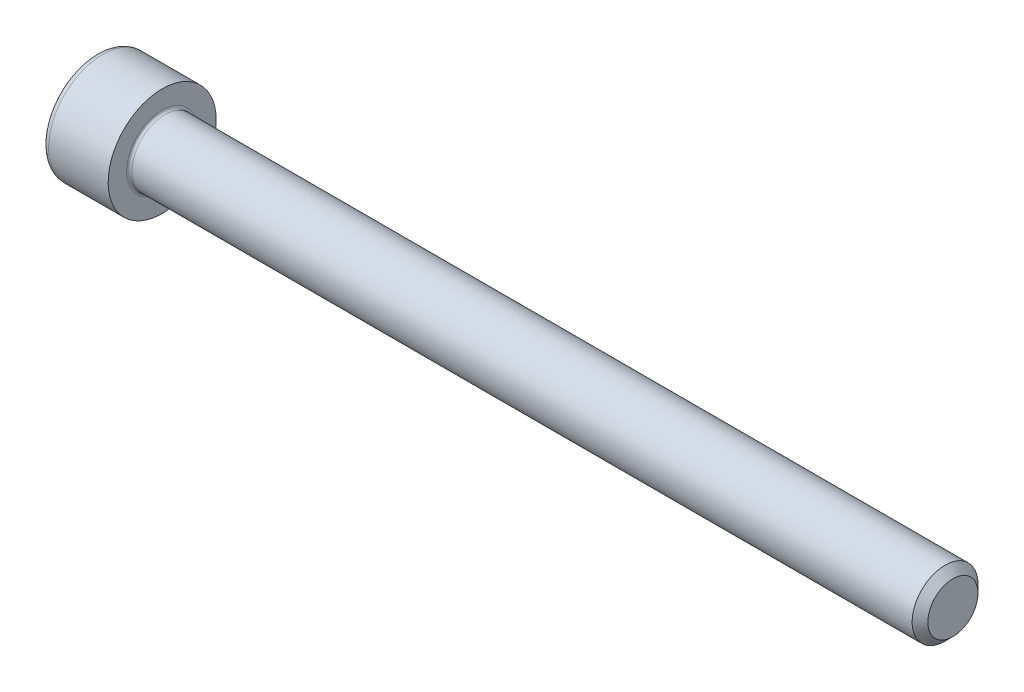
ISO-10303-21;
HEADER;
FILE_DESCRIPTION(('STEP AP214'),'2;1');
FILE_NAME('part.step','',(''),(''),'','','');
FILE_SCHEMA(('AUTOMOTIVE_DESIGN { 1 0 10303 214 1 1 1 1 }'));
ENDSEC;
DATA;
#1=APPLICATION_CONTEXT('core data for automotive mechanical design processes');
#2=APPLICATION_PROTOCOL_DEFINITION('international standard','automotive_design',2000,#1);
#3=PRODUCT_CONTEXT('',#1,'mechanical');
#4=PRODUCT('Part','Part','',(#3));
#5=PRODUCT_RELATED_PRODUCT_CATEGORY('part','',(#4));
#6=PRODUCT_DEFINITION_FORMATION('','',#4);
#7=PRODUCT_DEFINITION_CONTEXT('part definition',#1,'design');
#8=PRODUCT_DEFINITION('design','',#6,#7);
#9=PRODUCT_DEFINITION_SHAPE('','',#8);
#10=(LENGTH_UNIT() NAMED_UNIT(*) SI_UNIT(.MILLI.,.METRE.));
#11=(NAMED_UNIT(*) PLANE_ANGLE_UNIT() SI_UNIT($,.RADIAN.));
#12=(NAMED_UNIT(*) SI_UNIT($,.STERADIAN.) SOLID_ANGLE_UNIT());
#13=UNCERTAINTY_MEASURE_WITH_UNIT(LENGTH_MEASURE(1.E-05),#10,'distance_accuracy_value','');
#14=(GEOMETRIC_REPRESENTATION_CONTEXT(3) GLOBAL_UNCERTAINTY_ASSIGNED_CONTEXT((#13)) GLOBAL_UNIT_ASSIGNED_CONTEXT((#10,
#11,#12)) REPRESENTATION_CONTEXT('',''));
#15=CARTESIAN_POINT('',(0.,0.,0.));
#16=DIRECTION('',(0.,0.,1.));
#17=DIRECTION('',(1.,0.,0.));
#18=AXIS2_PLACEMENT_3D('',#15,#16,#17);
#19=CARTESIAN_POINT('',(-1.73197520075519,0.,0.));
#20=DIRECTION('',(-1.,0.,0.));
#21=DIRECTION('',(0.,0.,1.));
#22=AXIS2_PLACEMENT_3D('',#19,#20,#21);
#23=CONICAL_SURFACE('',#22,1.38675239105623,1.04719754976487);
#24=CARTESIAN_POINT('',(-0.931333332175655,-1.70530256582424E-10,0.));
#25=VERTEX_POINT('',#24);
#26=VERTEX_LOOP('',#25);
#27=FACE_BOUND('',#26,.T.);
#28=CARTESIAN_POINT('',(-1.72720000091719,1.19380000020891,0.689240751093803));
#29=CARTESIAN_POINT('',(-1.70970817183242,1.19380000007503,0.628664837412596));
#30=CARTESIAN_POINT('',(-1.69380026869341,1.19380000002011,0.567566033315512));
#31=CARTESIAN_POINT('',(-1.66603350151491,1.19379999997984,0.444310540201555));
#32=CARTESIAN_POINT('',(-1.65418445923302,1.19379999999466,0.382151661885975));
#33=CARTESIAN_POINT('',(-1.63574057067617,1.1938000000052,0.258604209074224));
#34=CARTESIAN_POINT('',(-1.62902295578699,1.19380000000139,0.197234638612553));
#35=CARTESIAN_POINT('',(-1.62100502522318,1.19379999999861,0.074206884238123));
#36=CARTESIAN_POINT('',(-1.61969806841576,1.19379999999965,0.0125491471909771));
#37=CARTESIAN_POINT('',(-1.62242392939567,1.1938000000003,-0.102651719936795));
#38=CARTESIAN_POINT('',(-1.62578745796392,1.19380000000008,-0.15621213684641));
#39=CARTESIAN_POINT('',(-1.63644571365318,1.19379999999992,-0.262984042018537));
#40=CARTESIAN_POINT('',(-1.64374407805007,1.19379999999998,-0.316195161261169));
#41=CARTESIAN_POINT('',(-1.66198857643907,1.19380000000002,-0.423187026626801));
#42=CARTESIAN_POINT('',(-1.67301201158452,1.19380000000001,-0.476954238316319));
#43=CARTESIAN_POINT('',(-1.69803054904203,1.19379999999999,-0.58368695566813));
#44=CARTESIAN_POINT('',(-1.71201977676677,1.19379999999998,-0.636653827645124));
#45=CARTESIAN_POINT('',(-1.72720000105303,1.1938,-0.689240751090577));
#46=B_SPLINE_CURVE_WITH_KNOTS('',3,(#28,#29,#30,#31,#32,#33,#34,#35,#36,#37,#38,#39,#40,#41,#42,
#43,#44,#45),.UNSPECIFIED.,.F.,.F.,(4,2,2,2,2,2,2,2,4),(0.,0.18922685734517,0.378908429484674,
0.563895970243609,0.748656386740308,0.909501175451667,1.07049490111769,1.23505869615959,
1.39929952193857),.UNSPECIFIED.);
#47=CARTESIAN_POINT('',(-1.72720000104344,1.19379999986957,0.68924075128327));
#48=VERTEX_POINT('',#47);
#49=CARTESIAN_POINT('',(-1.72720000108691,1.1938,-0.689240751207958));
#50=VERTEX_POINT('',#49);
#51=EDGE_CURVE('E20',#48,#50,#46,.T.);
#52=ORIENTED_EDGE('',*,*,#51,.T.);
#53=CARTESIAN_POINT('',(-1.72720000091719,1.19379999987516,-0.689240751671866));
#54=CARTESIAN_POINT('',(-1.70970817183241,1.14133971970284,-0.71952870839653));
#55=CARTESIAN_POINT('',(-1.6938002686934,1.08842660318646,-0.750078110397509));
#56=CARTESIAN_POINT('',(-1.6660335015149,0.981684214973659,-0.811705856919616));
#57=CARTESIAN_POINT('',(-1.65418445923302,0.927853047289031,-0.842785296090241));
#58=CARTESIAN_POINT('',(-1.63574057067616,0.820857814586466,-0.904559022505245));
#59=CARTESIAN_POINT('',(-1.62902295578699,0.767710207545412,-0.935243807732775));
#60=CARTESIAN_POINT('',(-1.62100502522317,0.661165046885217,-0.996757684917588));
#61=CARTESIAN_POINT('',(-1.61969806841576,0.607767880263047,-1.02758655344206));
#62=CARTESIAN_POINT('',(-1.62242392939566,0.508001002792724,-1.08518698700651));
#63=CARTESIAN_POINT('',(-1.62578745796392,0.461616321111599,-1.11196719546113));
#64=CARTESIAN_POINT('',(-1.63644571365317,0.369149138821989,-1.16535314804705));
#65=CARTESIAN_POINT('',(-1.64374407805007,0.323066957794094,-1.19195870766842));
#66=CARTESIAN_POINT('',(-1.66198857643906,0.230409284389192,-1.24545464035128));
#67=CARTESIAN_POINT('',(-1.67301201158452,0.183845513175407,-1.27233824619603));
#68=CARTESIAN_POINT('',(-1.69803054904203,0.0914122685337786,-1.32570460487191));
#69=CARTESIAN_POINT('',(-1.71201977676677,0.045541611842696,-1.3521880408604));
#70=CARTESIAN_POINT('',(-1.72720000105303,2.32076375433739E-10,-1.37848150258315));
#71=B_SPLINE_CURVE_WITH_KNOTS('',3,(#53,#54,#55,#56,#57,#58,#59,#60,#61,#62,#63,#64,#65,#66,#67,
#68,#69,#70),.UNSPECIFIED.,.F.,.F.,(4,2,2,2,2,2,2,2,4),(0.,0.18922685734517,0.378908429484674,
0.563895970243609,0.748656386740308,0.909501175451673,1.07049490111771,1.23505869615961,
1.3992995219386),.UNSPECIFIED.);
#72=CARTESIAN_POINT('',(-1.72720000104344,0.,-1.37848150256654));
#73=VERTEX_POINT('',#72);
#74=EDGE_CURVE('E80',#50,#73,#71,.T.);
#75=ORIENTED_EDGE('',*,*,#74,.T.);
#76=CARTESIAN_POINT('',(-1.72720000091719,-3.3375484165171E-10,-1.37848150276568));
#77=CARTESIAN_POINT('',(-1.70970817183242,-0.0524602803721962,-1.34819354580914));
#78=CARTESIAN_POINT('',(-1.69380026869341,-0.105373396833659,-1.31764414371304));
#79=CARTESIAN_POINT('',(-1.66603350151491,-0.212115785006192,-1.25601639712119));
#80=CARTESIAN_POINT('',(-1.65418445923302,-0.265946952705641,-1.22493695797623));
#81=CARTESIAN_POINT('',(-1.63574057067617,-0.372942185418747,-1.16316323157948));
#82=CARTESIAN_POINT('',(-1.62902295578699,-0.426089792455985,-1.13247844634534));
#83=CARTESIAN_POINT('',(-1.62100502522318,-0.532634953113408,-1.07096456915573));
#84=CARTESIAN_POINT('',(-1.61969806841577,-0.586032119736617,-1.04013570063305));
#85=CARTESIAN_POINT('',(-1.62242392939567,-0.685798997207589,-0.982535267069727));
#86=CARTESIAN_POINT('',(-1.62578745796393,-0.732183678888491,-0.955755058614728));
#87=CARTESIAN_POINT('',(-1.63644571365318,-0.824650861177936,-0.902369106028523));
#88=CARTESIAN_POINT('',(-1.64374407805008,-0.870733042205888,-0.875763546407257));
#89=CARTESIAN_POINT('',(-1.66198857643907,-0.963390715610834,-0.822267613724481));
#90=CARTESIAN_POINT('',(-1.67301201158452,-1.00995448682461,-0.795384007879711));
#91=CARTESIAN_POINT('',(-1.69803054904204,-1.10238773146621,-0.742017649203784));
#92=CARTESIAN_POINT('',(-1.71201977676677,-1.14825838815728,-0.715534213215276));
#93=CARTESIAN_POINT('',(-1.72720000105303,-1.19379999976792,-0.68924075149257));
#94=B_SPLINE_CURVE_WITH_KNOTS('',3,(#76,#77,#78,#79,#80,#81,#82,#83,#84,#85,#86,#87,#88,#89,#90,
#91,#92,#93),.UNSPECIFIED.,.F.,.F.,(4,2,2,2,2,2,2,2,4),(0.,0.189226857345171,0.378908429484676,
0.563895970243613,0.748656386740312,0.909501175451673,1.0704949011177,1.2350586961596,
1.39929952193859),.UNSPECIFIED.);
#95=CARTESIAN_POINT('',(-1.72720000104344,-1.19379999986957,-0.68924075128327));
#96=VERTEX_POINT('',#95);
#97=EDGE_CURVE('E105',#73,#96,#94,.T.);
#98=ORIENTED_EDGE('',*,*,#97,.T.);
#99=CARTESIAN_POINT('',(-1.72720000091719,-1.19380000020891,-0.689240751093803));
#100=CARTESIAN_POINT('',(-1.70970817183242,-1.19380000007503,-0.628664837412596));
#101=CARTESIAN_POINT('',(-1.69380026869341,-1.19380000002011,-0.567566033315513));
#102=CARTESIAN_POINT('',(-1.66603350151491,-1.19379999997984,-0.444310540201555));
#103=CARTESIAN_POINT('',(-1.65418445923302,-1.19379999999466,-0.382151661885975));
#104=CARTESIAN_POINT('',(-1.63574057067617,-1.1938000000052,-0.258604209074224));
#105=CARTESIAN_POINT('',(-1.62902295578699,-1.19380000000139,-0.197234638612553));
#106=CARTESIAN_POINT('',(-1.62100502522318,-1.19379999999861,-0.0742068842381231));
#107=CARTESIAN_POINT('',(-1.61969806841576,-1.19379999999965,-0.0125491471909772));
#108=CARTESIAN_POINT('',(-1.62242392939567,-1.1938000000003,0.102651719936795));
#109=CARTESIAN_POINT('',(-1.62578745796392,-1.19380000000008,0.15621213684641));
#110=CARTESIAN_POINT('',(-1.63644571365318,-1.19379999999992,0.262984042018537));
#111=CARTESIAN_POINT('',(-1.64374407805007,-1.19379999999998,0.316195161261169));
#112=CARTESIAN_POINT('',(-1.66198857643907,-1.19380000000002,0.423187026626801));
#113=CARTESIAN_POINT('',(-1.67301201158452,-1.19380000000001,0.476954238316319));
#114=CARTESIAN_POINT('',(-1.69803054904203,-1.19379999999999,0.58368695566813));
#115=CARTESIAN_POINT('',(-1.71201977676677,-1.19379999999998,0.636653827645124));
#116=CARTESIAN_POINT('',(-1.72720000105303,-1.1938,0.689240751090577));
#117=B_SPLINE_CURVE_WITH_KNOTS('',3,(#99,#100,#101,#102,#103,#104,#105,#106,#107,#108,#109,#110,
#111,#112,#113,#114,#115,#116),.UNSPECIFIED.,.F.,.F.,(4,2,2,2,2,2,2,2,4),(0.,0.18922685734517,
0.378908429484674,0.563895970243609,0.748656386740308,0.909501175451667,1.07049490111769,
1.23505869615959,1.39929952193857),.UNSPECIFIED.);
#118=CARTESIAN_POINT('',(-1.72720000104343,-1.19379999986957,0.689240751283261));
#119=VERTEX_POINT('',#118);
#120=EDGE_CURVE('E129',#96,#119,#117,.T.);
#121=ORIENTED_EDGE('',*,*,#120,.T.);
#122=CARTESIAN_POINT('',(-1.72720000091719,-1.19379999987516,0.689240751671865));
#123=CARTESIAN_POINT('',(-1.70970817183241,-1.14133971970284,0.71952870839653));
#124=CARTESIAN_POINT('',(-1.6938002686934,-1.08842660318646,0.750078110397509));
#125=CARTESIAN_POINT('',(-1.6660335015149,-0.981684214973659,0.811705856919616));
#126=CARTESIAN_POINT('',(-1.65418445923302,-0.927853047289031,0.842785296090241));
#127=CARTESIAN_POINT('',(-1.63574057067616,-0.820857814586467,0.904559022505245));
#128=CARTESIAN_POINT('',(-1.62902295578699,-0.767710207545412,0.935243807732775));
#129=CARTESIAN_POINT('',(-1.62100502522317,-0.661165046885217,0.996757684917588));
#130=CARTESIAN_POINT('',(-1.61969806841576,-0.607767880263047,1.02758655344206));
#131=CARTESIAN_POINT('',(-1.62242392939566,-0.508001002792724,1.08518698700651));
#132=CARTESIAN_POINT('',(-1.62578745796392,-0.461616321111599,1.11196719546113));
#133=CARTESIAN_POINT('',(-1.63644571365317,-0.36914913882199,1.16535314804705));
#134=CARTESIAN_POINT('',(-1.64374407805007,-0.323066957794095,1.19195870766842));
#135=CARTESIAN_POINT('',(-1.66198857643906,-0.230409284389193,1.24545464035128));
#136=CARTESIAN_POINT('',(-1.67301201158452,-0.183845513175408,1.27233824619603));
#137=CARTESIAN_POINT('',(-1.69803054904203,-0.0914122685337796,1.32570460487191));
#138=CARTESIAN_POINT('',(-1.71201977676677,-0.045541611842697,1.3521880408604));
#139=CARTESIAN_POINT('',(-1.72720000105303,-2.32077619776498E-10,1.37848150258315));
#140=B_SPLINE_CURVE_WITH_KNOTS('',3,(#122,#123,#124,#125,#126,#127,#128,#129,#130,#131,#132,
#133,#134,#135,#136,#137,#138,#139),.UNSPECIFIED.,.F.,.F.,(4,2,2,2,2,2,2,2,4),(0.,
0.18922685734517,0.378908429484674,0.563895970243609,0.748656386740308,0.909501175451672,
1.0704949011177,1.2350586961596,1.3992995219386),.UNSPECIFIED.);
#141=CARTESIAN_POINT('',(-1.72720000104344,0.,1.37848150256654));
#142=VERTEX_POINT('',#141);
#143=EDGE_CURVE('E137',#119,#142,#140,.T.);
#144=ORIENTED_EDGE('',*,*,#143,.T.);
#145=CARTESIAN_POINT('',(-1.72720000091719,3.33753688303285E-10,1.37848150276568));
#146=CARTESIAN_POINT('',(-1.70970817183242,0.0524602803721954,1.34819354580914));
#147=CARTESIAN_POINT('',(-1.69380026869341,0.105373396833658,1.31764414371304));
#148=CARTESIAN_POINT('',(-1.66603350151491,0.212115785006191,1.25601639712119));
#149=CARTESIAN_POINT('',(-1.65418445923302,0.26594695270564,1.22493695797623));
#150=CARTESIAN_POINT('',(-1.63574057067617,0.372942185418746,1.16316323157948));
#151=CARTESIAN_POINT('',(-1.62902295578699,0.426089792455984,1.13247844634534));
#152=CARTESIAN_POINT('',(-1.62100502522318,0.532634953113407,1.07096456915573));
#153=CARTESIAN_POINT('',(-1.61969806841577,0.586032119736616,1.04013570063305));
#154=CARTESIAN_POINT('',(-1.62242392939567,0.685798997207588,0.982535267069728));
#155=CARTESIAN_POINT('',(-1.62578745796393,0.732183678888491,0.955755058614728));
#156=CARTESIAN_POINT('',(-1.63644571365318,0.824650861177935,0.902369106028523));
#157=CARTESIAN_POINT('',(-1.64374407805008,0.870733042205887,0.875763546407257));
#158=CARTESIAN_POINT('',(-1.66198857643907,0.963390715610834,0.822267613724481));
#159=CARTESIAN_POINT('',(-1.67301201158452,1.00995448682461,0.795384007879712));
#160=CARTESIAN_POINT('',(-1.69803054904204,1.10238773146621,0.742017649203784));
#161=CARTESIAN_POINT('',(-1.71201977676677,1.14825838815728,0.715534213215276));
#162=CARTESIAN_POINT('',(-1.72720000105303,1.19379999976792,0.68924075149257));
#163=B_SPLINE_CURVE_WITH_KNOTS('',3,(#145,#146,#147,#148,#149,#150,#151,#152,#153,#154,#155,
#156,#157,#158,#159,#160,#161,#162),.UNSPECIFIED.,.F.,.F.,(4,2,2,2,2,2,2,2,4),(0.,
0.189226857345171,0.378908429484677,0.563895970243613,0.748656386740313,0.909501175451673,
1.0704949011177,1.2350586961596,1.39929952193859),.UNSPECIFIED.);
#164=EDGE_CURVE('E82',#142,#48,#163,.T.);
#165=ORIENTED_EDGE('',*,*,#164,.T.);
#166=EDGE_LOOP('',(#52,#75,#98,#121,#144,#165));
#167=FACE_BOUND('',#166,.T.);
#168=ADVANCED_FACE('F16',(#27,#167),#23,.F.);
#169=CARTESIAN_POINT('',(-3.175,1.1938,0.689240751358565));
#170=DIRECTION('',(0.,1.,0.));
#171=DIRECTION('',(0.,0.,1.));
#172=AXIS2_PLACEMENT_3D('',#169,#170,#171);
#173=PLANE('',#172);
#174=DIRECTION('',(1.,0.,0.));
#175=VECTOR('',#174,1.);
#176=CARTESIAN_POINT('',(-3.175,1.19380000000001,0.689240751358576));
#177=LINE('',#176,#175);
#178=CARTESIAN_POINT('',(-3.175,1.1938,0.689240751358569));
#179=VERTEX_POINT('',#178);
#180=EDGE_CURVE('E84',#48,#179,#177,.F.);
#181=ORIENTED_EDGE('',*,*,#180,.T.);
#182=DIRECTION('',(0.,0.,1.));
#183=VECTOR('',#182,1.);
#184=CARTESIAN_POINT('',(-3.175,1.1938,0.));
#185=LINE('',#184,#183);
#186=CARTESIAN_POINT('',(-3.175,1.1938,-0.689240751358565));
#187=VERTEX_POINT('',#186);
#188=EDGE_CURVE('E89',#187,#179,#185,.T.);
#189=ORIENTED_EDGE('',*,*,#188,.F.);
#190=DIRECTION('',(1.,0.,0.));
#191=VECTOR('',#190,1.);
#192=CARTESIAN_POINT('',(-3.175,1.1938,-0.689240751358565));
#193=LINE('',#192,#191);
#194=EDGE_CURVE('E87',#187,#50,#193,.T.);
#195=ORIENTED_EDGE('',*,*,#194,.T.);
#196=ORIENTED_EDGE('',*,*,#51,.F.);
#197=EDGE_LOOP('',(#181,#189,#195,#196));
#198=FACE_BOUND('',#197,.T.);
#199=ADVANCED_FACE('F76',(#198),#173,.F.);
#200=CARTESIAN_POINT('',(-3.175,0.,1.37848150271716));
#201=DIRECTION('',(0.,0.5,0.866025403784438));
#202=DIRECTION('',(0.,-0.866025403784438,0.5));
#203=AXIS2_PLACEMENT_3D('',#200,#201,#202);
#204=PLANE('',#203);
#205=DIRECTION('',(1.,0.,0.));
#206=VECTOR('',#205,1.);
#207=CARTESIAN_POINT('',(-3.175,0.,1.37848150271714));
#208=LINE('',#207,#206);
#209=CARTESIAN_POINT('',(-3.175,0.,1.37848150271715));
#210=VERTEX_POINT('',#209);
#211=EDGE_CURVE('E141',#142,#210,#208,.F.);
#212=ORIENTED_EDGE('',*,*,#211,.T.);
#213=DIRECTION('',(0.,-0.866025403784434,0.500000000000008));
#214=VECTOR('',#213,1.);
#215=CARTESIAN_POINT('',(-3.175,1.1938,0.689240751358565));
#216=LINE('',#215,#214);
#217=EDGE_CURVE('E95',#179,#210,#216,.T.);
#218=ORIENTED_EDGE('',*,*,#217,.F.);
#219=ORIENTED_EDGE('',*,*,#180,.F.);
#220=ORIENTED_EDGE('',*,*,#164,.F.);
#221=EDGE_LOOP('',(#212,#218,#219,#220));
#222=FACE_BOUND('',#221,.T.);
#223=ADVANCED_FACE('F145',(#222),#204,.F.);
#224=CARTESIAN_POINT('',(-3.175,-1.1938,0.689240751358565));
#225=DIRECTION('',(0.,-0.5,0.866025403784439));
#226=DIRECTION('',(0.,-0.866025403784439,-0.5));
#227=AXIS2_PLACEMENT_3D('',#224,#225,#226);
#228=PLANE('',#227);
#229=DIRECTION('',(1.,0.,0.));
#230=VECTOR('',#229,1.);
#231=CARTESIAN_POINT('',(-3.175,-1.1938,0.689240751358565));
#232=LINE('',#231,#230);
#233=CARTESIAN_POINT('',(-3.175,-1.1938,0.689240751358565));
#234=VERTEX_POINT('',#233);
#235=EDGE_CURVE('E136',#119,#234,#232,.F.);
#236=ORIENTED_EDGE('',*,*,#235,.T.);
#237=DIRECTION('',(0.,-0.866025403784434,-0.500000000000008));
#238=VECTOR('',#237,1.);
#239=CARTESIAN_POINT('',(-3.175,0.,1.37848150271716));
#240=LINE('',#239,#238);
#241=EDGE_CURVE('E264',#210,#234,#240,.T.);
#242=ORIENTED_EDGE('',*,*,#241,.F.);
#243=ORIENTED_EDGE('',*,*,#211,.F.);
#244=ORIENTED_EDGE('',*,*,#143,.F.);
#245=EDGE_LOOP('',(#236,#242,#243,#244));
#246=FACE_BOUND('',#245,.T.);
#247=ADVANCED_FACE('F125',(#246),#228,.F.);
#248=CARTESIAN_POINT('',(-3.175,-1.1938,-0.689240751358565));
#249=DIRECTION('',(0.,-1.,0.));
#250=DIRECTION('',(0.,0.,-1.));
#251=AXIS2_PLACEMENT_3D('',#248,#249,#250);
#252=PLANE('',#251);
#253=DIRECTION('',(1.,0.,0.));
#254=VECTOR('',#253,1.);
#255=CARTESIAN_POINT('',(-3.175,-1.19380000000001,-0.689240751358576));
#256=LINE('',#255,#254);
#257=CARTESIAN_POINT('',(-3.175,-1.1938,-0.68924075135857));
#258=VERTEX_POINT('',#257);
#259=EDGE_CURVE('E135',#96,#258,#256,.F.);
#260=ORIENTED_EDGE('',*,*,#259,.T.);
#261=DIRECTION('',(0.,0.,1.));
#262=VECTOR('',#261,1.);
#263=CARTESIAN_POINT('',(-3.175,-1.1938,0.));
#264=LINE('',#263,#262);
#265=EDGE_CURVE('E259',#234,#258,#264,.F.);
#266=ORIENTED_EDGE('',*,*,#265,.F.);
#267=ORIENTED_EDGE('',*,*,#235,.F.);
#268=ORIENTED_EDGE('',*,*,#120,.F.);
#269=EDGE_LOOP('',(#260,#266,#267,#268));
#270=FACE_BOUND('',#269,.T.);
#271=ADVANCED_FACE('F121',(#270),#252,.F.);
#272=CARTESIAN_POINT('',(-3.175,0.,-1.37848150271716));
#273=DIRECTION('',(0.,-0.5,-0.866025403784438));
#274=DIRECTION('',(0.,0.866025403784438,-0.5));
#275=AXIS2_PLACEMENT_3D('',#272,#273,#274);
#276=PLANE('',#275);
#277=DIRECTION('',(1.,0.,0.));
#278=VECTOR('',#277,1.);
#279=CARTESIAN_POINT('',(-3.175,0.,-1.37848150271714));
#280=LINE('',#279,#278);
#281=CARTESIAN_POINT('',(-3.175,0.,-1.37848150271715));
#282=VERTEX_POINT('',#281);
#283=EDGE_CURVE('E38',#73,#282,#280,.F.);
#284=ORIENTED_EDGE('',*,*,#283,.T.);
#285=DIRECTION('',(0.,0.866025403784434,-0.500000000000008));
#286=VECTOR('',#285,1.);
#287=CARTESIAN_POINT('',(-3.175,-1.1938,-0.689240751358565));
#288=LINE('',#287,#286);
#289=EDGE_CURVE('E254',#258,#282,#288,.T.);
#290=ORIENTED_EDGE('',*,*,#289,.F.);
#291=ORIENTED_EDGE('',*,*,#259,.F.);
#292=ORIENTED_EDGE('',*,*,#97,.F.);
#293=EDGE_LOOP('',(#284,#290,#291,#292));
#294=FACE_BOUND('',#293,.T.);
#295=ADVANCED_FACE('F115',(#294),#276,.F.);
#296=CARTESIAN_POINT('',(-3.175,1.1938,-0.689240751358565));
#297=DIRECTION('',(0.,0.5,-0.866025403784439));
#298=DIRECTION('',(0.,0.866025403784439,0.5));
#299=AXIS2_PLACEMENT_3D('',#296,#297,#298);
#300=PLANE('',#299);
#301=ORIENTED_EDGE('',*,*,#194,.F.);
#302=DIRECTION('',(0.,0.866025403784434,0.500000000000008));
#303=VECTOR('',#302,1.);
#304=CARTESIAN_POINT('',(-3.175,0.,-1.37848150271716));
#305=LINE('',#304,#303);
#306=EDGE_CURVE('E252',#282,#187,#305,.T.);
#307=ORIENTED_EDGE('',*,*,#306,.F.);
#308=ORIENTED_EDGE('',*,*,#283,.F.);
#309=ORIENTED_EDGE('',*,*,#74,.F.);
#310=EDGE_LOOP('',(#301,#307,#308,#309));
#311=FACE_BOUND('',#310,.T.);
#312=ADVANCED_FACE('F93',(#311),#300,.F.);
#313=CARTESIAN_POINT('',(-3.175,1.99099075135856,0.));
#314=DIRECTION('',(-1.,0.,0.));
#315=DIRECTION('',(0.,0.,1.));
#316=AXIS2_PLACEMENT_3D('',#313,#314,#315);
#317=PLANE('',#316);
#318=ORIENTED_EDGE('',*,*,#289,.T.);
#319=ORIENTED_EDGE('',*,*,#306,.T.);
#320=ORIENTED_EDGE('',*,*,#188,.T.);
#321=ORIENTED_EDGE('',*,*,#217,.T.);
#322=ORIENTED_EDGE('',*,*,#241,.T.);
#323=ORIENTED_EDGE('',*,*,#265,.T.);
#324=EDGE_LOOP('',(#318,#319,#320,#321,#322,#323));
#325=FACE_BOUND('',#324,.T.);
#326=CARTESIAN_POINT('',(-3.175,0.,0.));
#327=DIRECTION('',(1.,0.,0.));
#328=DIRECTION('',(0.,1.,0.));
#329=AXIS2_PLACEMENT_3D('',#326,#327,#328);
#330=CIRCLE('',#329,2.2987);
#331=CARTESIAN_POINT('',(-3.175,2.2987,0.));
#332=VERTEX_POINT('',#331);
#333=EDGE_CURVE('E215',#332,#332,#330,.T.);
#334=ORIENTED_EDGE('',*,*,#333,.F.);
#335=EDGE_LOOP('',(#334));
#336=FACE_BOUND('',#335,.T.);
#337=ADVANCED_FACE('F114',(#325,#336),#317,.T.);
#338=CARTESIAN_POINT('',(-2.8702,0.,0.));
#339=DIRECTION('',(1.,0.,0.));
#340=DIRECTION('',(0.,0.,-1.));
#341=AXIS2_PLACEMENT_3D('',#338,#339,#340);
#342=TOROIDAL_SURFACE('',#341,2.2987,0.3048);
#343=CARTESIAN_POINT('',(-2.8702,0.,0.));
#344=DIRECTION('',(1.,0.,0.));
#345=DIRECTION('',(0.,1.,0.));
#346=AXIS2_PLACEMENT_3D('',#343,#344,#345);
#347=CIRCLE('',#346,2.6035);
#348=CARTESIAN_POINT('',(-2.8702,2.6035,0.));
#349=VERTEX_POINT('',#348);
#350=EDGE_CURVE('E279',#349,#349,#347,.T.);
#351=ORIENTED_EDGE('',*,*,#350,.F.);
#352=EDGE_LOOP('',(#351));
#353=FACE_BOUND('',#352,.T.);
#354=ORIENTED_EDGE('',*,*,#333,.T.);
#355=EDGE_LOOP('',(#354));
#356=FACE_BOUND('',#355,.T.);
#357=ADVANCED_FACE('F199',(#353,#356),#342,.T.);
#358=CARTESIAN_POINT('',(-1.5875,0.,0.));
#359=DIRECTION('',(1.,0.,0.));
#360=DIRECTION('',(0.,1.,0.));
#361=AXIS2_PLACEMENT_3D('',#358,#359,#360);
#362=CYLINDRICAL_SURFACE('',#361,2.6035);
#363=ORIENTED_EDGE('',*,*,#350,.T.);
#364=EDGE_LOOP('',(#363));
#365=FACE_BOUND('',#364,.T.);
#366=CARTESIAN_POINT('',(0.,0.,0.));
#367=DIRECTION('',(1.,0.,0.));
#368=DIRECTION('',(0.,1.,0.));
#369=AXIS2_PLACEMENT_3D('',#366,#367,#368);
#370=CIRCLE('',#369,2.6035);
#371=CARTESIAN_POINT('',(0.,2.6035,0.));
#372=VERTEX_POINT('',#371);
#373=EDGE_CURVE('E103',#372,#372,#370,.T.);
#374=ORIENTED_EDGE('',*,*,#373,.F.);
#375=EDGE_LOOP('',(#374));
#376=FACE_BOUND('',#375,.T.);
#377=ADVANCED_FACE('F196',(#365,#376),#362,.T.);
#378=CARTESIAN_POINT('',(38.1,0.79375,0.));
#379=DIRECTION('',(1.,0.,0.));
#380=DIRECTION('',(0.,0.,-1.));
#381=AXIS2_PLACEMENT_3D('',#378,#379,#380);
#382=PLANE('',#381);
#383=CARTESIAN_POINT('',(38.1000000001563,0.,0.));
#384=DIRECTION('',(-1.,0.,0.));
#385=DIRECTION('',(0.,0.,1.));
#386=AXIS2_PLACEMENT_3D('',#383,#384,#385);
#387=CIRCLE('',#386,1.20904000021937);
#388=CARTESIAN_POINT('',(38.1000000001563,0.,1.20904000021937));
#389=VERTEX_POINT('',#388);
#390=EDGE_CURVE('E274',#389,#389,#387,.T.);
#391=ORIENTED_EDGE('',*,*,#390,.F.);
#392=EDGE_LOOP('',(#391));
#393=FACE_BOUND('',#392,.T.);
#394=ADVANCED_FACE('F193',(#393),#382,.T.);
#395=CARTESIAN_POINT('',(0.,2.0955,0.));
#396=DIRECTION('',(1.,0.,0.));
#397=DIRECTION('',(0.,0.,-1.));
#398=AXIS2_PLACEMENT_3D('',#395,#396,#397);
#399=PLANE('',#398);
#400=CARTESIAN_POINT('',(0.,0.,0.));
#401=DIRECTION('',(1.,0.,0.));
#402=DIRECTION('',(0.,1.,0.));
#403=AXIS2_PLACEMENT_3D('',#400,#401,#402);
#404=CIRCLE('',#403,1.7145);
#405=CARTESIAN_POINT('',(0.,1.7145,0.));
#406=VERTEX_POINT('',#405);
#407=EDGE_CURVE('E180',#406,#406,#404,.F.);
#408=ORIENTED_EDGE('',*,*,#407,.T.);
#409=EDGE_LOOP('',(#408));
#410=FACE_BOUND('',#409,.T.);
#411=ORIENTED_EDGE('',*,*,#373,.T.);
#412=EDGE_LOOP('',(#411));
#413=FACE_BOUND('',#412,.T.);
#414=ADVANCED_FACE('F184',(#410,#413),#399,.T.);
#415=CARTESIAN_POINT('',(37.7215399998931,0.,0.));
#416=DIRECTION('',(-1.,0.,0.));
#417=DIRECTION('',(0.,0.,1.));
#418=AXIS2_PLACEMENT_3D('',#415,#416,#417);
#419=CONICAL_SURFACE('',#418,1.58749999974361,0.78539816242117);
#420=ORIENTED_EDGE('',*,*,#390,.T.);
#421=EDGE_LOOP('',(#420));
#422=FACE_BOUND('',#421,.T.);
#423=CARTESIAN_POINT('',(37.72154,0.,0.));
#424=DIRECTION('',(1.,0.,0.));
#425=DIRECTION('',(0.,1.,0.));
#426=AXIS2_PLACEMENT_3D('',#423,#424,#425);
#427=CIRCLE('',#426,1.5875);
#428=CARTESIAN_POINT('',(37.72154,1.5875,0.));
#429=VERTEX_POINT('',#428);
#430=EDGE_CURVE('E29',#429,#429,#427,.F.);
#431=ORIENTED_EDGE('',*,*,#430,.F.);
#432=EDGE_LOOP('',(#431));
#433=FACE_BOUND('',#432,.T.);
#434=ADVANCED_FACE('F162',(#422,#433),#419,.T.);
#435=CARTESIAN_POINT('',(0.127,0.,0.));
#436=DIRECTION('',(1.,0.,0.));
#437=DIRECTION('',(0.,0.,-1.));
#438=AXIS2_PLACEMENT_3D('',#435,#436,#437);
#439=TOROIDAL_SURFACE('',#438,1.7145,0.127);
#440=CARTESIAN_POINT('',(0.126999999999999,0.,0.));
#441=DIRECTION('',(1.,0.,0.));
#442=DIRECTION('',(0.,1.,0.));
#443=AXIS2_PLACEMENT_3D('',#440,#441,#442);
#444=CIRCLE('',#443,1.5875);
#445=CARTESIAN_POINT('',(0.126999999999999,1.5875,0.));
#446=VERTEX_POINT('',#445);
#447=EDGE_CURVE('E11',#446,#446,#444,.T.);
#448=ORIENTED_EDGE('',*,*,#447,.F.);
#449=EDGE_LOOP('',(#448));
#450=FACE_BOUND('',#449,.T.);
#451=ORIENTED_EDGE('',*,*,#407,.F.);
#452=EDGE_LOOP('',(#451));
#453=FACE_BOUND('',#452,.T.);
#454=ADVANCED_FACE('F156',(#450,#453),#439,.F.);
#455=CARTESIAN_POINT('',(28.575,0.,0.));
#456=DIRECTION('',(1.,0.,0.));
#457=DIRECTION('',(0.,1.,0.));
#458=AXIS2_PLACEMENT_3D('',#455,#456,#457);
#459=CYLINDRICAL_SURFACE('',#458,1.5875);
#460=ORIENTED_EDGE('',*,*,#447,.T.);
#461=EDGE_LOOP('',(#460));
#462=FACE_BOUND('',#461,.T.);
#463=ORIENTED_EDGE('',*,*,#430,.T.);
#464=EDGE_LOOP('',(#463));
#465=FACE_BOUND('',#464,.T.);
#466=ADVANCED_FACE('F154',(#462,#465),#459,.T.);
#467=CLOSED_SHELL('',(#168,#199,#223,#247,#271,#295,#312,#337,#357,#377,#394,#414,#434,#454,#466));
#468=MANIFOLD_SOLID_BREP('B1',#467);
#469=ADVANCED_BREP_SHAPE_REPRESENTATION('',(#18,#468),#14);
#470=SHAPE_DEFINITION_REPRESENTATION(#9,#469);
ENDSEC;
END-ISO-10303-21;
